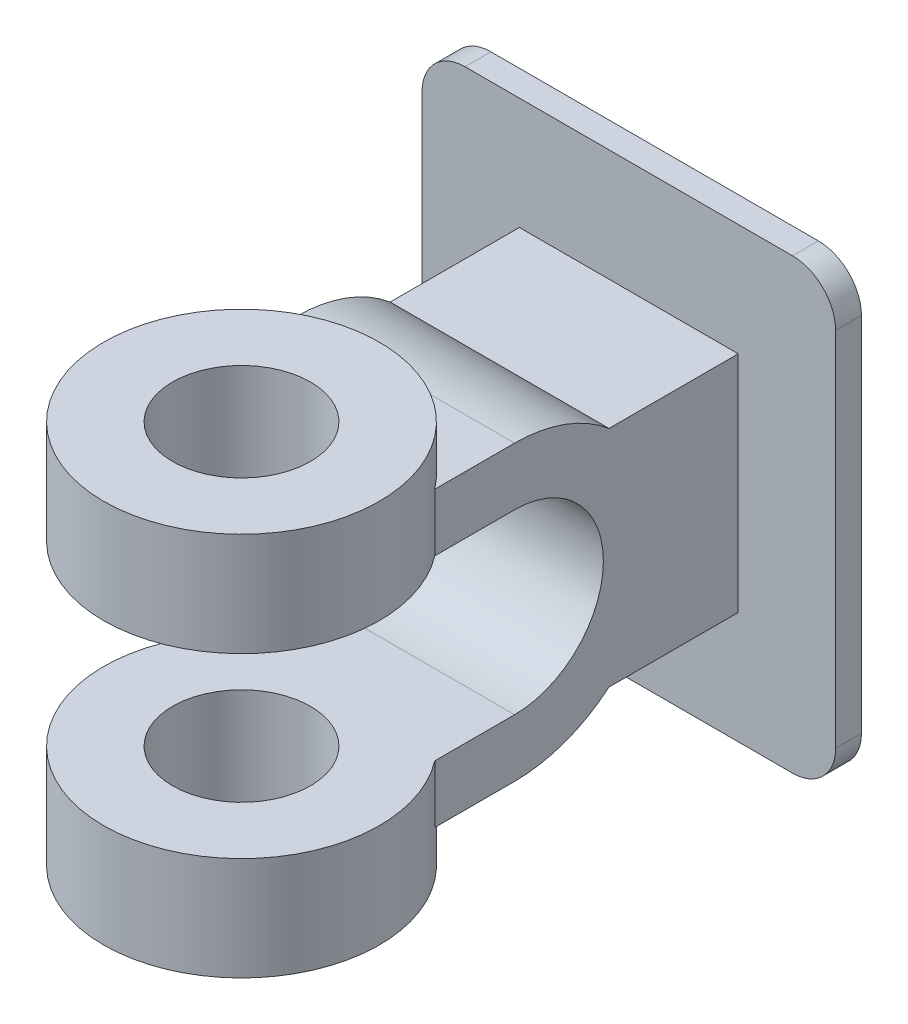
ISO-10303-21;
HEADER;
FILE_DESCRIPTION(('STEP AP214'),'2;1');
FILE_NAME('part.step','',(''),(''),'','','');
FILE_SCHEMA(('AUTOMOTIVE_DESIGN { 1 0 10303 214 1 1 1 1 }'));
ENDSEC;
DATA;
#1=APPLICATION_CONTEXT('core data for automotive mechanical design processes');
#2=APPLICATION_PROTOCOL_DEFINITION('international standard','automotive_design',2000,#1);
#3=PRODUCT_CONTEXT('',#1,'mechanical');
#4=PRODUCT('Part','Part','',(#3));
#5=PRODUCT_RELATED_PRODUCT_CATEGORY('part','',(#4));
#6=PRODUCT_DEFINITION_FORMATION('','',#4);
#7=PRODUCT_DEFINITION_CONTEXT('part definition',#1,'design');
#8=PRODUCT_DEFINITION('design','',#6,#7);
#9=PRODUCT_DEFINITION_SHAPE('','',#8);
#10=(LENGTH_UNIT() NAMED_UNIT(*) SI_UNIT(.MILLI.,.METRE.));
#11=(NAMED_UNIT(*) PLANE_ANGLE_UNIT() SI_UNIT($,.RADIAN.));
#12=(NAMED_UNIT(*) SI_UNIT($,.STERADIAN.) SOLID_ANGLE_UNIT());
#13=UNCERTAINTY_MEASURE_WITH_UNIT(LENGTH_MEASURE(1.E-05),#10,'distance_accuracy_value','');
#14=(GEOMETRIC_REPRESENTATION_CONTEXT(3) GLOBAL_UNCERTAINTY_ASSIGNED_CONTEXT((#13)) GLOBAL_UNIT_ASSIGNED_CONTEXT((#10,
#11,#12)) REPRESENTATION_CONTEXT('',''));
#15=CARTESIAN_POINT('',(0.,0.,0.));
#16=DIRECTION('',(0.,0.,1.));
#17=DIRECTION('',(1.,0.,0.));
#18=AXIS2_PLACEMENT_3D('',#15,#16,#17);
#19=CARTESIAN_POINT('',(5.55625,0.,-1.99024165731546));
#20=DIRECTION('',(1.,0.,0.));
#21=DIRECTION('',(0.,0.,-1.));
#22=AXIS2_PLACEMENT_3D('',#19,#20,#21);
#23=PLANE('',#22);
#24=DIRECTION('',(0.,0.,1.));
#25=VECTOR('',#24,1.);
#26=CARTESIAN_POINT('',(5.55625,7.4375,-1.99024165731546));
#27=LINE('',#26,#25);
#28=CARTESIAN_POINT('',(5.55625,7.4375,-1.99024165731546));
#29=VERTEX_POINT('',#28);
#30=CARTESIAN_POINT('',(5.55625,7.4375,2.06454934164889));
#31=VERTEX_POINT('',#30);
#32=EDGE_CURVE('E390',#29,#31,#27,.T.);
#33=ORIENTED_EDGE('',*,*,#32,.T.);
#34=DIRECTION('',(0.,-1.,0.));
#35=VECTOR('',#34,1.);
#36=CARTESIAN_POINT('',(5.55625,9.75625,2.06454934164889));
#37=LINE('',#36,#35);
#38=CARTESIAN_POINT('',(5.55625,4.50625,2.06454934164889));
#39=VERTEX_POINT('',#38);
#40=EDGE_CURVE('E342',#31,#39,#37,.T.);
#41=ORIENTED_EDGE('',*,*,#40,.T.);
#42=DIRECTION('',(0.,0.,-1.));
#43=VECTOR('',#42,1.);
#44=CARTESIAN_POINT('',(5.55625,4.50625,-1.99024165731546));
#45=LINE('',#44,#43);
#46=CARTESIAN_POINT('',(5.55625,4.50625,-1.99024165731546));
#47=VERTEX_POINT('',#46);
#48=EDGE_CURVE('E394',#39,#47,#45,.T.);
#49=ORIENTED_EDGE('',*,*,#48,.T.);
#50=CARTESIAN_POINT('',(5.55625,0.,-1.99024165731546));
#51=DIRECTION('',(-1.,0.,0.));
#52=DIRECTION('',(0.,0.,-1.));
#53=AXIS2_PLACEMENT_3D('',#50,#51,#52);
#54=CIRCLE('',#53,4.50625);
#55=CARTESIAN_POINT('',(5.55625,-4.50625,-1.99024165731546));
#56=VERTEX_POINT('',#55);
#57=EDGE_CURVE('E364',#47,#56,#54,.T.);
#58=ORIENTED_EDGE('',*,*,#57,.T.);
#59=DIRECTION('',(0.,0.,1.));
#60=VECTOR('',#59,1.);
#61=CARTESIAN_POINT('',(5.55625,-4.50625,-1.99024165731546));
#62=LINE('',#61,#60);
#63=CARTESIAN_POINT('',(5.55625,-4.50625,2.06454934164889));
#64=VERTEX_POINT('',#63);
#65=EDGE_CURVE('E368',#56,#64,#62,.T.);
#66=ORIENTED_EDGE('',*,*,#65,.T.);
#67=DIRECTION('',(0.,1.,0.));
#68=VECTOR('',#67,1.);
#69=CARTESIAN_POINT('',(5.55625,-9.75625,2.06454934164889));
#70=LINE('',#69,#68);
#71=CARTESIAN_POINT('',(5.55625,-7.4375,2.06454934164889));
#72=VERTEX_POINT('',#71);
#73=EDGE_CURVE('E360',#72,#64,#70,.T.);
#74=ORIENTED_EDGE('',*,*,#73,.F.);
#75=DIRECTION('',(0.,0.,-1.));
#76=VECTOR('',#75,1.);
#77=CARTESIAN_POINT('',(5.55625,-7.4375,-1.99024165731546));
#78=LINE('',#77,#76);
#79=CARTESIAN_POINT('',(5.55625,-7.4375,-1.99024165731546));
#80=VERTEX_POINT('',#79);
#81=EDGE_CURVE('E373',#72,#80,#78,.T.);
#82=ORIENTED_EDGE('',*,*,#81,.T.);
#83=CARTESIAN_POINT('',(5.55625,0.,-1.99024165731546));
#84=DIRECTION('',(1.,0.,0.));
#85=DIRECTION('',(0.,0.,-1.));
#86=AXIS2_PLACEMENT_3D('',#83,#84,#85);
#87=CIRCLE('',#86,7.4375);
#88=CARTESIAN_POINT('',(5.55625,-5.6875,-6.78281403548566));
#89=VERTEX_POINT('',#88);
#90=EDGE_CURVE('E376',#80,#89,#87,.T.);
#91=ORIENTED_EDGE('',*,*,#90,.T.);
#92=DIRECTION('',(0.,0.,-1.));
#93=VECTOR('',#92,1.);
#94=CARTESIAN_POINT('',(5.55625,-5.6875,-6.78281403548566));
#95=LINE('',#94,#93);
#96=CARTESIAN_POINT('',(5.55625,-5.6875,-13.3453140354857));
#97=VERTEX_POINT('',#96);
#98=EDGE_CURVE('E379',#89,#97,#95,.T.);
#99=ORIENTED_EDGE('',*,*,#98,.T.);
#100=DIRECTION('',(0.,1.,0.));
#101=VECTOR('',#100,1.);
#102=CARTESIAN_POINT('',(5.55625,5.6875,-13.3453140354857));
#103=LINE('',#102,#101);
#104=CARTESIAN_POINT('',(5.55625,5.6875,-13.3453140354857));
#105=VERTEX_POINT('',#104);
#106=EDGE_CURVE('E217',#97,#105,#103,.T.);
#107=ORIENTED_EDGE('',*,*,#106,.T.);
#108=DIRECTION('',(0.,0.,1.));
#109=VECTOR('',#108,1.);
#110=CARTESIAN_POINT('',(5.55625,5.6875,-6.78281403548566));
#111=LINE('',#110,#109);
#112=CARTESIAN_POINT('',(5.55625,5.6875,-6.78281403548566));
#113=VERTEX_POINT('',#112);
#114=EDGE_CURVE('E384',#105,#113,#111,.T.);
#115=ORIENTED_EDGE('',*,*,#114,.T.);
#116=CARTESIAN_POINT('',(5.55625,0.,-1.99024165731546));
#117=DIRECTION('',(1.,0.,0.));
#118=DIRECTION('',(0.,0.,-1.));
#119=AXIS2_PLACEMENT_3D('',#116,#117,#118);
#120=CIRCLE('',#119,7.4375);
#121=EDGE_CURVE('E387',#113,#29,#120,.T.);
#122=ORIENTED_EDGE('',*,*,#121,.T.);
#123=EDGE_LOOP('',(#33,#41,#49,#58,#66,#74,#82,#91,#99,#107,#115,#122));
#124=FACE_BOUND('',#123,.T.);
#125=ADVANCED_FACE('F50',(#124),#23,.T.);
#126=CARTESIAN_POINT('',(-5.55625,0.,-1.99024165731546));
#127=DIRECTION('',(1.,0.,0.));
#128=DIRECTION('',(0.,0.,-1.));
#129=AXIS2_PLACEMENT_3D('',#126,#127,#128);
#130=PLANE('',#129);
#131=DIRECTION('',(0.,-1.,0.));
#132=VECTOR('',#131,1.);
#133=CARTESIAN_POINT('',(-5.55625,9.75625,2.06454934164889));
#134=LINE('',#133,#132);
#135=CARTESIAN_POINT('',(-5.55625,7.4375,2.06454934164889));
#136=VERTEX_POINT('',#135);
#137=CARTESIAN_POINT('',(-5.55625,4.50625,2.06454934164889));
#138=VERTEX_POINT('',#137);
#139=EDGE_CURVE('E240',#136,#138,#134,.T.);
#140=ORIENTED_EDGE('',*,*,#139,.F.);
#141=DIRECTION('',(0.,0.,1.));
#142=VECTOR('',#141,1.);
#143=CARTESIAN_POINT('',(-5.55625,7.4375,-1.99024165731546));
#144=LINE('',#143,#142);
#145=CARTESIAN_POINT('',(-5.55625,7.4375,-1.99024165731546));
#146=VERTEX_POINT('',#145);
#147=EDGE_CURVE('E415',#146,#136,#144,.T.);
#148=ORIENTED_EDGE('',*,*,#147,.F.);
#149=CARTESIAN_POINT('',(-5.55625,0.,-1.99024165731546));
#150=DIRECTION('',(1.,0.,0.));
#151=DIRECTION('',(0.,0.,-1.));
#152=AXIS2_PLACEMENT_3D('',#149,#150,#151);
#153=CIRCLE('',#152,7.4375);
#154=CARTESIAN_POINT('',(-5.55625,5.6875,-6.78281403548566));
#155=VERTEX_POINT('',#154);
#156=EDGE_CURVE('E412',#155,#146,#153,.T.);
#157=ORIENTED_EDGE('',*,*,#156,.F.);
#158=DIRECTION('',(0.,0.,1.));
#159=VECTOR('',#158,1.);
#160=CARTESIAN_POINT('',(-5.55625,5.6875,-6.78281403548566));
#161=LINE('',#160,#159);
#162=CARTESIAN_POINT('',(-5.55625,5.6875,-13.3453140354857));
#163=VERTEX_POINT('',#162);
#164=EDGE_CURVE('E197',#163,#155,#161,.T.);
#165=ORIENTED_EDGE('',*,*,#164,.F.);
#166=DIRECTION('',(0.,1.,0.));
#167=VECTOR('',#166,1.);
#168=CARTESIAN_POINT('',(-5.55625,5.6875,-13.3453140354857));
#169=LINE('',#168,#167);
#170=CARTESIAN_POINT('',(-5.55625,-5.6875,-13.3453140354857));
#171=VERTEX_POINT('',#170);
#172=EDGE_CURVE('E190',#171,#163,#169,.T.);
#173=ORIENTED_EDGE('',*,*,#172,.F.);
#174=DIRECTION('',(0.,0.,-1.));
#175=VECTOR('',#174,1.);
#176=CARTESIAN_POINT('',(-5.55625,-5.6875,-6.78281403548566));
#177=LINE('',#176,#175);
#178=CARTESIAN_POINT('',(-5.55625,-5.6875,-6.78281403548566));
#179=VERTEX_POINT('',#178);
#180=EDGE_CURVE('E195',#179,#171,#177,.T.);
#181=ORIENTED_EDGE('',*,*,#180,.F.);
#182=CARTESIAN_POINT('',(-5.55625,0.,-1.99024165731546));
#183=DIRECTION('',(1.,0.,0.));
#184=DIRECTION('',(0.,0.,-1.));
#185=AXIS2_PLACEMENT_3D('',#182,#183,#184);
#186=CIRCLE('',#185,7.4375);
#187=CARTESIAN_POINT('',(-5.55625,-7.4375,-1.99024165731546));
#188=VERTEX_POINT('',#187);
#189=EDGE_CURVE('E213',#188,#179,#186,.T.);
#190=ORIENTED_EDGE('',*,*,#189,.F.);
#191=DIRECTION('',(0.,0.,-1.));
#192=VECTOR('',#191,1.);
#193=CARTESIAN_POINT('',(-5.55625,-7.4375,-1.99024165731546));
#194=LINE('',#193,#192);
#195=CARTESIAN_POINT('',(-5.55625,-7.4375,2.06454934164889));
#196=VERTEX_POINT('',#195);
#197=EDGE_CURVE('E405',#196,#188,#194,.T.);
#198=ORIENTED_EDGE('',*,*,#197,.F.);
#199=DIRECTION('',(0.,1.,0.));
#200=VECTOR('',#199,1.);
#201=CARTESIAN_POINT('',(-5.55625,-9.75625,2.06454934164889));
#202=LINE('',#201,#200);
#203=CARTESIAN_POINT('',(-5.55625,-4.50625,2.06454934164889));
#204=VERTEX_POINT('',#203);
#205=EDGE_CURVE('E236',#196,#204,#202,.T.);
#206=ORIENTED_EDGE('',*,*,#205,.T.);
#207=DIRECTION('',(0.,0.,1.));
#208=VECTOR('',#207,1.);
#209=CARTESIAN_POINT('',(-5.55625,-4.50625,-1.99024165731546));
#210=LINE('',#209,#208);
#211=CARTESIAN_POINT('',(-5.55625,-4.50625,-1.99024165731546));
#212=VERTEX_POINT('',#211);
#213=EDGE_CURVE('E401',#212,#204,#210,.T.);
#214=ORIENTED_EDGE('',*,*,#213,.F.);
#215=CARTESIAN_POINT('',(-5.55625,0.,-1.99024165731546));
#216=DIRECTION('',(-1.,0.,0.));
#217=DIRECTION('',(0.,0.,-1.));
#218=AXIS2_PLACEMENT_3D('',#215,#216,#217);
#219=CIRCLE('',#218,4.50625);
#220=CARTESIAN_POINT('',(-5.55625,4.50625,-1.99024165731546));
#221=VERTEX_POINT('',#220);
#222=EDGE_CURVE('E363',#221,#212,#219,.T.);
#223=ORIENTED_EDGE('',*,*,#222,.F.);
#224=DIRECTION('',(0.,0.,-1.));
#225=VECTOR('',#224,1.);
#226=CARTESIAN_POINT('',(-5.55625,4.50625,-1.99024165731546));
#227=LINE('',#226,#225);
#228=EDGE_CURVE('E369',#138,#221,#227,.T.);
#229=ORIENTED_EDGE('',*,*,#228,.F.);
#230=EDGE_LOOP('',(#140,#148,#157,#165,#173,#181,#190,#198,#206,#214,#223,#229));
#231=FACE_BOUND('',#230,.T.);
#232=ADVANCED_FACE('F193',(#231),#130,.F.);
#233=CARTESIAN_POINT('',(5.55625,0.,-1.99024165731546));
#234=DIRECTION('',(-1.,0.,0.));
#235=DIRECTION('',(0.,0.,1.));
#236=AXIS2_PLACEMENT_3D('',#233,#234,#235);
#237=CYLINDRICAL_SURFACE('',#236,4.50625);
#238=ORIENTED_EDGE('',*,*,#222,.T.);
#239=DIRECTION('',(-1.,0.,0.));
#240=VECTOR('',#239,1.);
#241=CARTESIAN_POINT('',(5.55625,-4.50625,-1.99024165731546));
#242=LINE('',#241,#240);
#243=EDGE_CURVE('E232',#56,#212,#242,.T.);
#244=ORIENTED_EDGE('',*,*,#243,.F.);
#245=ORIENTED_EDGE('',*,*,#57,.F.);
#246=DIRECTION('',(-1.,0.,0.));
#247=VECTOR('',#246,1.);
#248=CARTESIAN_POINT('',(5.55625,4.50625,-1.99024165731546));
#249=LINE('',#248,#247);
#250=EDGE_CURVE('E397',#47,#221,#249,.T.);
#251=ORIENTED_EDGE('',*,*,#250,.T.);
#252=EDGE_LOOP('',(#238,#244,#245,#251));
#253=FACE_BOUND('',#252,.T.);
#254=ADVANCED_FACE('F459',(#253),#237,.F.);
#255=CARTESIAN_POINT('',(5.55625,-4.50625,-1.99024165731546));
#256=DIRECTION('',(0.,-1.,0.));
#257=DIRECTION('',(0.,0.,-1.));
#258=AXIS2_PLACEMENT_3D('',#255,#256,#257);
#259=PLANE('',#258);
#260=CARTESIAN_POINT('',(0.,-4.50625,6.32225834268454));
#261=DIRECTION('',(0.,1.,0.));
#262=DIRECTION('',(0.,0.,1.));
#263=AXIS2_PLACEMENT_3D('',#260,#261,#262);
#264=CIRCLE('',#263,3.5);
#265=CARTESIAN_POINT('',(0.,-4.50625,9.82225834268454));
#266=VERTEX_POINT('',#265);
#267=EDGE_CURVE('E246',#266,#266,#264,.T.);
#268=ORIENTED_EDGE('',*,*,#267,.F.);
#269=EDGE_LOOP('',(#268));
#270=FACE_BOUND('',#269,.T.);
#271=ORIENTED_EDGE('',*,*,#213,.T.);
#272=CARTESIAN_POINT('',(0.,-4.50625,6.32225834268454));
#273=DIRECTION('',(0.,1.,0.));
#274=DIRECTION('',(0.,0.,1.));
#275=AXIS2_PLACEMENT_3D('',#272,#273,#274);
#276=CIRCLE('',#275,7.);
#277=EDGE_CURVE('E245',#204,#64,#276,.T.);
#278=ORIENTED_EDGE('',*,*,#277,.T.);
#279=ORIENTED_EDGE('',*,*,#65,.F.);
#280=ORIENTED_EDGE('',*,*,#243,.T.);
#281=EDGE_LOOP('',(#271,#278,#279,#280));
#282=FACE_BOUND('',#281,.T.);
#283=ADVANCED_FACE('F673',(#270,#282),#259,.F.);
#284=CARTESIAN_POINT('',(5.55625,-7.4375,-1.99024165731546));
#285=DIRECTION('',(0.,1.,0.));
#286=DIRECTION('',(0.,0.,1.));
#287=AXIS2_PLACEMENT_3D('',#284,#285,#286);
#288=PLANE('',#287);
#289=ORIENTED_EDGE('',*,*,#81,.F.);
#290=CARTESIAN_POINT('',(0.,-7.4375,6.32225834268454));
#291=DIRECTION('',(0.,1.,0.));
#292=DIRECTION('',(0.,0.,1.));
#293=AXIS2_PLACEMENT_3D('',#290,#291,#292);
#294=CIRCLE('',#293,7.);
#295=EDGE_CURVE('E353',#72,#196,#294,.T.);
#296=ORIENTED_EDGE('',*,*,#295,.T.);
#297=ORIENTED_EDGE('',*,*,#197,.T.);
#298=DIRECTION('',(-1.,0.,0.));
#299=VECTOR('',#298,1.);
#300=CARTESIAN_POINT('',(5.55625,-7.4375,-1.99024165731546));
#301=LINE('',#300,#299);
#302=EDGE_CURVE('E223',#80,#188,#301,.T.);
#303=ORIENTED_EDGE('',*,*,#302,.F.);
#304=EDGE_LOOP('',(#289,#296,#297,#303));
#305=FACE_BOUND('',#304,.T.);
#306=ADVANCED_FACE('F664',(#305),#288,.F.);
#307=CARTESIAN_POINT('',(5.55625,0.,-1.99024165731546));
#308=DIRECTION('',(-1.,0.,0.));
#309=DIRECTION('',(0.,0.,1.));
#310=AXIS2_PLACEMENT_3D('',#307,#308,#309);
#311=CYLINDRICAL_SURFACE('',#310,7.4375);
#312=ORIENTED_EDGE('',*,*,#189,.T.);
#313=DIRECTION('',(-1.,0.,0.));
#314=VECTOR('',#313,1.);
#315=CARTESIAN_POINT('',(5.55625,-5.6875,-6.78281403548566));
#316=LINE('',#315,#314);
#317=EDGE_CURVE('E211',#89,#179,#316,.T.);
#318=ORIENTED_EDGE('',*,*,#317,.F.);
#319=ORIENTED_EDGE('',*,*,#90,.F.);
#320=ORIENTED_EDGE('',*,*,#302,.T.);
#321=EDGE_LOOP('',(#312,#318,#319,#320));
#322=FACE_BOUND('',#321,.T.);
#323=ADVANCED_FACE('F452',(#322),#311,.T.);
#324=CARTESIAN_POINT('',(5.55625,-5.6875,-6.78281403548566));
#325=DIRECTION('',(0.,1.,0.));
#326=DIRECTION('',(0.,0.,1.));
#327=AXIS2_PLACEMENT_3D('',#324,#325,#326);
#328=PLANE('',#327);
#329=ORIENTED_EDGE('',*,*,#180,.T.);
#330=DIRECTION('',(-1.,0.,0.));
#331=VECTOR('',#330,1.);
#332=CARTESIAN_POINT('',(5.55625,-5.6875,-13.3453140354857));
#333=LINE('',#332,#331);
#334=EDGE_CURVE('E208',#97,#171,#333,.T.);
#335=ORIENTED_EDGE('',*,*,#334,.F.);
#336=ORIENTED_EDGE('',*,*,#98,.F.);
#337=ORIENTED_EDGE('',*,*,#317,.T.);
#338=EDGE_LOOP('',(#329,#335,#336,#337));
#339=FACE_BOUND('',#338,.T.);
#340=ADVANCED_FACE('F206',(#339),#328,.F.);
#341=CARTESIAN_POINT('',(5.55625,5.6875,-6.78281403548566));
#342=DIRECTION('',(0.,-1.,0.));
#343=DIRECTION('',(0.,0.,-1.));
#344=AXIS2_PLACEMENT_3D('',#341,#342,#343);
#345=PLANE('',#344);
#346=ORIENTED_EDGE('',*,*,#164,.T.);
#347=DIRECTION('',(-1.,0.,0.));
#348=VECTOR('',#347,1.);
#349=CARTESIAN_POINT('',(5.55625,5.6875,-6.78281403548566));
#350=LINE('',#349,#348);
#351=EDGE_CURVE('E225',#113,#155,#350,.T.);
#352=ORIENTED_EDGE('',*,*,#351,.F.);
#353=ORIENTED_EDGE('',*,*,#114,.F.);
#354=DIRECTION('',(-1.,0.,0.));
#355=VECTOR('',#354,1.);
#356=CARTESIAN_POINT('',(5.55625,5.6875,-13.3453140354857));
#357=LINE('',#356,#355);
#358=EDGE_CURVE('E219',#105,#163,#357,.T.);
#359=ORIENTED_EDGE('',*,*,#358,.T.);
#360=EDGE_LOOP('',(#346,#352,#353,#359));
#361=FACE_BOUND('',#360,.T.);
#362=ADVANCED_FACE('F444',(#361),#345,.F.);
#363=CARTESIAN_POINT('',(5.55625,0.,-1.99024165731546));
#364=DIRECTION('',(-1.,0.,0.));
#365=DIRECTION('',(0.,0.,1.));
#366=AXIS2_PLACEMENT_3D('',#363,#364,#365);
#367=CYLINDRICAL_SURFACE('',#366,7.4375);
#368=ORIENTED_EDGE('',*,*,#156,.T.);
#369=DIRECTION('',(-1.,0.,0.));
#370=VECTOR('',#369,1.);
#371=CARTESIAN_POINT('',(5.55625,7.4375,-1.99024165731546));
#372=LINE('',#371,#370);
#373=EDGE_CURVE('E424',#29,#146,#372,.T.);
#374=ORIENTED_EDGE('',*,*,#373,.F.);
#375=ORIENTED_EDGE('',*,*,#121,.F.);
#376=ORIENTED_EDGE('',*,*,#351,.T.);
#377=EDGE_LOOP('',(#368,#374,#375,#376));
#378=FACE_BOUND('',#377,.T.);
#379=ADVANCED_FACE('F432',(#378),#367,.T.);
#380=CARTESIAN_POINT('',(5.55625,7.4375,-1.99024165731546));
#381=DIRECTION('',(0.,-1.,0.));
#382=DIRECTION('',(0.,0.,-1.));
#383=AXIS2_PLACEMENT_3D('',#380,#381,#382);
#384=PLANE('',#383);
#385=CARTESIAN_POINT('',(0.,7.4375,6.32225834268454));
#386=DIRECTION('',(0.,-1.,0.));
#387=DIRECTION('',(0.,0.,-1.));
#388=AXIS2_PLACEMENT_3D('',#385,#386,#387);
#389=CIRCLE('',#388,7.);
#390=EDGE_CURVE('E337',#31,#136,#389,.F.);
#391=ORIENTED_EDGE('',*,*,#390,.F.);
#392=ORIENTED_EDGE('',*,*,#32,.F.);
#393=ORIENTED_EDGE('',*,*,#373,.T.);
#394=ORIENTED_EDGE('',*,*,#147,.T.);
#395=EDGE_LOOP('',(#391,#392,#393,#394));
#396=FACE_BOUND('',#395,.T.);
#397=ADVANCED_FACE('F440',(#396),#384,.F.);
#398=CARTESIAN_POINT('',(5.55625,4.50625,-1.99024165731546));
#399=DIRECTION('',(0.,1.,0.));
#400=DIRECTION('',(0.,0.,1.));
#401=AXIS2_PLACEMENT_3D('',#398,#399,#400);
#402=PLANE('',#401);
#403=CARTESIAN_POINT('',(0.,4.50625,6.32225834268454));
#404=DIRECTION('',(0.,1.,0.));
#405=DIRECTION('',(0.,0.,1.));
#406=AXIS2_PLACEMENT_3D('',#403,#404,#405);
#407=CIRCLE('',#406,3.5);
#408=CARTESIAN_POINT('',(0.,4.50625,2.82225834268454));
#409=VERTEX_POINT('',#408);
#410=EDGE_CURVE('E256',#409,#409,#407,.T.);
#411=ORIENTED_EDGE('',*,*,#410,.T.);
#412=EDGE_LOOP('',(#411));
#413=FACE_BOUND('',#412,.T.);
#414=ORIENTED_EDGE('',*,*,#48,.F.);
#415=CARTESIAN_POINT('',(0.,4.50625,6.32225834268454));
#416=DIRECTION('',(0.,1.,0.));
#417=DIRECTION('',(0.,0.,1.));
#418=AXIS2_PLACEMENT_3D('',#415,#416,#417);
#419=CIRCLE('',#418,7.);
#420=EDGE_CURVE('E255',#138,#39,#419,.T.);
#421=ORIENTED_EDGE('',*,*,#420,.F.);
#422=ORIENTED_EDGE('',*,*,#228,.T.);
#423=ORIENTED_EDGE('',*,*,#250,.F.);
#424=EDGE_LOOP('',(#414,#421,#422,#423));
#425=FACE_BOUND('',#424,.T.);
#426=ADVANCED_FACE('F465',(#413,#425),#402,.F.);
#427=CARTESIAN_POINT('',(0.,-9.75625,6.32225834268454));
#428=DIRECTION('',(0.,1.,0.));
#429=DIRECTION('',(0.,0.,1.));
#430=AXIS2_PLACEMENT_3D('',#427,#428,#429);
#431=CYLINDRICAL_SURFACE('',#430,7.);
#432=CARTESIAN_POINT('',(0.,-9.75625,6.32225834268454));
#433=DIRECTION('',(0.,1.,0.));
#434=DIRECTION('',(0.,0.,1.));
#435=AXIS2_PLACEMENT_3D('',#432,#433,#434);
#436=CIRCLE('',#435,7.);
#437=CARTESIAN_POINT('',(0.,-9.75625,13.3222583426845));
#438=VERTEX_POINT('',#437);
#439=EDGE_CURVE('E349',#438,#438,#436,.T.);
#440=ORIENTED_EDGE('',*,*,#439,.T.);
#441=EDGE_LOOP('',(#440));
#442=FACE_BOUND('',#441,.T.);
#443=ORIENTED_EDGE('',*,*,#295,.F.);
#444=ORIENTED_EDGE('',*,*,#73,.T.);
#445=ORIENTED_EDGE('',*,*,#277,.F.);
#446=ORIENTED_EDGE('',*,*,#205,.F.);
#447=EDGE_LOOP('',(#443,#444,#445,#446));
#448=FACE_BOUND('',#447,.T.);
#449=ADVANCED_FACE('F462',(#442,#448),#431,.T.);
#450=CARTESIAN_POINT('',(0.,-9.75625,6.32225834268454));
#451=DIRECTION('',(0.,1.,0.));
#452=DIRECTION('',(0.,0.,1.));
#453=AXIS2_PLACEMENT_3D('',#450,#451,#452);
#454=PLANE('',#453);
#455=CARTESIAN_POINT('',(0.,-9.75625,6.32225834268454));
#456=DIRECTION('',(0.,1.,0.));
#457=DIRECTION('',(0.,0.,1.));
#458=AXIS2_PLACEMENT_3D('',#455,#456,#457);
#459=CIRCLE('',#458,3.5);
#460=CARTESIAN_POINT('',(0.,-9.75625,9.82225834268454));
#461=VERTEX_POINT('',#460);
#462=EDGE_CURVE('E241',#461,#461,#459,.T.);
#463=ORIENTED_EDGE('',*,*,#462,.T.);
#464=EDGE_LOOP('',(#463));
#465=FACE_BOUND('',#464,.T.);
#466=ORIENTED_EDGE('',*,*,#439,.F.);
#467=EDGE_LOOP('',(#466));
#468=FACE_BOUND('',#467,.T.);
#469=ADVANCED_FACE('F488',(#465,#468),#454,.F.);
#470=CARTESIAN_POINT('',(0.,-15.88125,6.32225834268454));
#471=DIRECTION('',(0.,1.,0.));
#472=DIRECTION('',(0.,0.,1.));
#473=AXIS2_PLACEMENT_3D('',#470,#471,#472);
#474=CYLINDRICAL_SURFACE('',#473,3.5);
#475=CARTESIAN_POINT('',(0.,-4.50625,9.82225834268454));
#476=CARTESIAN_POINT('',(0.,-4.5609375,9.82225834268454));
#477=CARTESIAN_POINT('',(0.,-4.615625,9.82225834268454));
#478=CARTESIAN_POINT('',(0.,-4.725,9.82225834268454));
#479=CARTESIAN_POINT('',(0.,-4.7796875,9.82225834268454));
#480=CARTESIAN_POINT('',(0.,-4.8890625,9.82225834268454));
#481=CARTESIAN_POINT('',(0.,-4.94375,9.82225834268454));
#482=CARTESIAN_POINT('',(0.,-5.053125,9.82225834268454));
#483=CARTESIAN_POINT('',(0.,-5.1078125,9.82225834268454));
#484=CARTESIAN_POINT('',(0.,-5.2171875,9.82225834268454));
#485=CARTESIAN_POINT('',(0.,-5.271875,9.82225834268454));
#486=CARTESIAN_POINT('',(0.,-5.38125,9.82225834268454));
#487=CARTESIAN_POINT('',(0.,-5.4359375,9.82225834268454));
#488=CARTESIAN_POINT('',(0.,-5.5453125,9.82225834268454));
#489=CARTESIAN_POINT('',(0.,-5.6,9.82225834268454));
#490=CARTESIAN_POINT('',(0.,-5.709375,9.82225834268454));
#491=CARTESIAN_POINT('',(0.,-5.7640625,9.82225834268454));
#492=CARTESIAN_POINT('',(0.,-5.8734375,9.82225834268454));
#493=CARTESIAN_POINT('',(0.,-5.928125,9.82225834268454));
#494=CARTESIAN_POINT('',(0.,-6.0375,9.82225834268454));
#495=CARTESIAN_POINT('',(0.,-6.0921875,9.82225834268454));
#496=CARTESIAN_POINT('',(0.,-6.2015625,9.82225834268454));
#497=CARTESIAN_POINT('',(0.,-6.25625,9.82225834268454));
#498=CARTESIAN_POINT('',(0.,-6.365625,9.82225834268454));
#499=CARTESIAN_POINT('',(0.,-6.4203125,9.82225834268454));
#500=CARTESIAN_POINT('',(0.,-6.5296875,9.82225834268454));
#501=CARTESIAN_POINT('',(0.,-6.584375,9.82225834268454));
#502=CARTESIAN_POINT('',(0.,-6.69375,9.82225834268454));
#503=CARTESIAN_POINT('',(0.,-6.7484375,9.82225834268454));
#504=CARTESIAN_POINT('',(0.,-6.8578125,9.82225834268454));
#505=CARTESIAN_POINT('',(0.,-6.9125,9.82225834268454));
#506=CARTESIAN_POINT('',(0.,-7.021875,9.82225834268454));
#507=CARTESIAN_POINT('',(0.,-7.0765625,9.82225834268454));
#508=CARTESIAN_POINT('',(0.,-7.1859375,9.82225834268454));
#509=CARTESIAN_POINT('',(0.,-7.240625,9.82225834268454));
#510=CARTESIAN_POINT('',(0.,-7.35,9.82225834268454));
#511=CARTESIAN_POINT('',(0.,-7.4046875,9.82225834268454));
#512=CARTESIAN_POINT('',(0.,-7.5140625,9.82225834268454));
#513=CARTESIAN_POINT('',(0.,-7.56875,9.82225834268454));
#514=CARTESIAN_POINT('',(0.,-7.678125,9.82225834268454));
#515=CARTESIAN_POINT('',(0.,-7.7328125,9.82225834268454));
#516=CARTESIAN_POINT('',(0.,-7.8421875,9.82225834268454));
#517=CARTESIAN_POINT('',(0.,-7.896875,9.82225834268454));
#518=CARTESIAN_POINT('',(0.,-8.00625,9.82225834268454));
#519=CARTESIAN_POINT('',(0.,-8.0609375,9.82225834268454));
#520=CARTESIAN_POINT('',(0.,-8.1703125,9.82225834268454));
#521=CARTESIAN_POINT('',(0.,-8.225,9.82225834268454));
#522=CARTESIAN_POINT('',(0.,-8.334375,9.82225834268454));
#523=CARTESIAN_POINT('',(0.,-8.3890625,9.82225834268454));
#524=CARTESIAN_POINT('',(0.,-8.4984375,9.82225834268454));
#525=CARTESIAN_POINT('',(0.,-8.553125,9.82225834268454));
#526=CARTESIAN_POINT('',(0.,-8.6625,9.82225834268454));
#527=CARTESIAN_POINT('',(0.,-8.7171875,9.82225834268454));
#528=CARTESIAN_POINT('',(0.,-8.8265625,9.82225834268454));
#529=CARTESIAN_POINT('',(0.,-8.88125,9.82225834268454));
#530=CARTESIAN_POINT('',(0.,-8.990625,9.82225834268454));
#531=CARTESIAN_POINT('',(0.,-9.0453125,9.82225834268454));
#532=CARTESIAN_POINT('',(0.,-9.1546875,9.82225834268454));
#533=CARTESIAN_POINT('',(0.,-9.209375,9.82225834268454));
#534=CARTESIAN_POINT('',(0.,-9.31875,9.82225834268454));
#535=CARTESIAN_POINT('',(0.,-9.3734375,9.82225834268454));
#536=CARTESIAN_POINT('',(0.,-9.4828125,9.82225834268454));
#537=CARTESIAN_POINT('',(0.,-9.5375,9.82225834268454));
#538=CARTESIAN_POINT('',(0.,-9.646875,9.82225834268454));
#539=CARTESIAN_POINT('',(0.,-9.7015625,9.82225834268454));
#540=CARTESIAN_POINT('',(0.,-9.75625,9.82225834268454));
#541=B_SPLINE_CURVE_WITH_KNOTS('',3,(#475,#476,#477,#478,#479,#480,#481,#482,#483,#484,#485,
#486,#487,#488,#489,#490,#491,#492,#493,#494,#495,#496,#497,#498,#499,#500,#501,#502,#503,#504,
#505,#506,#507,#508,#509,#510,#511,#512,#513,#514,#515,#516,#517,#518,#519,#520,#521,#522,#523,
#524,#525,#526,#527,#528,#529,#530,#531,#532,#533,#534,#535,#536,#537,#538,#539,#540),
.UNSPECIFIED.,.F.,.F.,(4,2,2,2,2,2,2,2,2,2,2,2,2,2,2,2,2,2,2,2,2,2,2,2,2,2,2,2,2,2,2,2,4),(0.,
0.164062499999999,0.328125,0.4921875,0.656250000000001,0.8203125,0.984375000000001,1.1484375,
1.3125,1.4765625,1.640625,1.8046875,1.96875,2.1328125,2.296875,2.4609375,2.625,2.7890625,
2.953125,3.1171875,3.28125,3.4453125,3.609375,3.7734375,3.9375,4.1015625,4.265625,4.4296875,
4.59375,4.7578125,4.921875,5.0859375,5.25),.UNSPECIFIED.);
#542=EDGE_CURVE('BSEAM497',#266,#461,#541,.T.);
#543=ORIENTED_EDGE('',*,*,#267,.T.);
#544=ORIENTED_EDGE('',*,*,#462,.F.);
#545=ORIENTED_EDGE('',*,*,#542,.T.);
#546=ORIENTED_EDGE('',*,*,#542,.F.);
#547=EDGE_LOOP('',(#543,#545,#544,#546));
#548=FACE_BOUND('',#547,.T.);
#549=ADVANCED_FACE('F497',(#548),#474,.F.);
#550=CARTESIAN_POINT('',(0.,9.75625,6.32225834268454));
#551=DIRECTION('',(0.,-1.,0.));
#552=DIRECTION('',(0.,0.,-1.));
#553=AXIS2_PLACEMENT_3D('',#550,#551,#552);
#554=CYLINDRICAL_SURFACE('',#553,7.);
#555=ORIENTED_EDGE('',*,*,#40,.F.);
#556=ORIENTED_EDGE('',*,*,#390,.T.);
#557=ORIENTED_EDGE('',*,*,#139,.T.);
#558=ORIENTED_EDGE('',*,*,#420,.T.);
#559=EDGE_LOOP('',(#555,#556,#557,#558));
#560=FACE_BOUND('',#559,.T.);
#561=CARTESIAN_POINT('',(0.,9.75625,6.32225834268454));
#562=DIRECTION('',(0.,1.,0.));
#563=DIRECTION('',(0.,0.,1.));
#564=AXIS2_PLACEMENT_3D('',#561,#562,#563);
#565=CIRCLE('',#564,7.);
#566=CARTESIAN_POINT('',(0.,9.75625,13.3222583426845));
#567=VERTEX_POINT('',#566);
#568=EDGE_CURVE('E333',#567,#567,#565,.T.);
#569=ORIENTED_EDGE('',*,*,#568,.F.);
#570=EDGE_LOOP('',(#569));
#571=FACE_BOUND('',#570,.T.);
#572=ADVANCED_FACE('F505',(#560,#571),#554,.T.);
#573=CARTESIAN_POINT('',(0.,9.75625,6.32225834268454));
#574=DIRECTION('',(0.,-1.,0.));
#575=DIRECTION('',(0.,0.,1.));
#576=AXIS2_PLACEMENT_3D('',#573,#574,#575);
#577=PLANE('',#576);
#578=CARTESIAN_POINT('',(0.,9.75625,6.32225834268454));
#579=DIRECTION('',(0.,-1.,0.));
#580=DIRECTION('',(0.,0.,-1.));
#581=AXIS2_PLACEMENT_3D('',#578,#579,#580);
#582=CIRCLE('',#581,3.5);
#583=CARTESIAN_POINT('',(0.,9.75625,2.82225834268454));
#584=VERTEX_POINT('',#583);
#585=EDGE_CURVE('E251',#584,#584,#582,.F.);
#586=ORIENTED_EDGE('',*,*,#585,.F.);
#587=EDGE_LOOP('',(#586));
#588=FACE_BOUND('',#587,.T.);
#589=ORIENTED_EDGE('',*,*,#568,.T.);
#590=EDGE_LOOP('',(#589));
#591=FACE_BOUND('',#590,.T.);
#592=ADVANCED_FACE('F514',(#588,#591),#577,.F.);
#593=CARTESIAN_POINT('',(0.,15.88125,6.32225834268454));
#594=DIRECTION('',(0.,-1.,0.));
#595=DIRECTION('',(0.,0.,-1.));
#596=AXIS2_PLACEMENT_3D('',#593,#594,#595);
#597=CYLINDRICAL_SURFACE('',#596,3.5);
#598=CARTESIAN_POINT('',(0.,4.50625,2.82225834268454));
#599=CARTESIAN_POINT('',(0.,4.5609375,2.82225834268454));
#600=CARTESIAN_POINT('',(0.,4.615625,2.82225834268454));
#601=CARTESIAN_POINT('',(0.,4.725,2.82225834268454));
#602=CARTESIAN_POINT('',(0.,4.7796875,2.82225834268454));
#603=CARTESIAN_POINT('',(0.,4.8890625,2.82225834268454));
#604=CARTESIAN_POINT('',(0.,4.94375,2.82225834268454));
#605=CARTESIAN_POINT('',(0.,5.053125,2.82225834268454));
#606=CARTESIAN_POINT('',(0.,5.1078125,2.82225834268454));
#607=CARTESIAN_POINT('',(0.,5.2171875,2.82225834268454));
#608=CARTESIAN_POINT('',(0.,5.271875,2.82225834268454));
#609=CARTESIAN_POINT('',(0.,5.38125,2.82225834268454));
#610=CARTESIAN_POINT('',(0.,5.4359375,2.82225834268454));
#611=CARTESIAN_POINT('',(0.,5.5453125,2.82225834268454));
#612=CARTESIAN_POINT('',(0.,5.6,2.82225834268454));
#613=CARTESIAN_POINT('',(0.,5.709375,2.82225834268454));
#614=CARTESIAN_POINT('',(0.,5.7640625,2.82225834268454));
#615=CARTESIAN_POINT('',(0.,5.8734375,2.82225834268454));
#616=CARTESIAN_POINT('',(0.,5.928125,2.82225834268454));
#617=CARTESIAN_POINT('',(0.,6.0375,2.82225834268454));
#618=CARTESIAN_POINT('',(0.,6.0921875,2.82225834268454));
#619=CARTESIAN_POINT('',(0.,6.2015625,2.82225834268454));
#620=CARTESIAN_POINT('',(0.,6.25625,2.82225834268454));
#621=CARTESIAN_POINT('',(0.,6.365625,2.82225834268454));
#622=CARTESIAN_POINT('',(0.,6.4203125,2.82225834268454));
#623=CARTESIAN_POINT('',(0.,6.5296875,2.82225834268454));
#624=CARTESIAN_POINT('',(0.,6.584375,2.82225834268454));
#625=CARTESIAN_POINT('',(0.,6.69375,2.82225834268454));
#626=CARTESIAN_POINT('',(0.,6.7484375,2.82225834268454));
#627=CARTESIAN_POINT('',(0.,6.8578125,2.82225834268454));
#628=CARTESIAN_POINT('',(0.,6.9125,2.82225834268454));
#629=CARTESIAN_POINT('',(0.,7.021875,2.82225834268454));
#630=CARTESIAN_POINT('',(0.,7.0765625,2.82225834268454));
#631=CARTESIAN_POINT('',(0.,7.1859375,2.82225834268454));
#632=CARTESIAN_POINT('',(0.,7.240625,2.82225834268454));
#633=CARTESIAN_POINT('',(0.,7.35,2.82225834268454));
#634=CARTESIAN_POINT('',(0.,7.4046875,2.82225834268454));
#635=CARTESIAN_POINT('',(0.,7.5140625,2.82225834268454));
#636=CARTESIAN_POINT('',(0.,7.56875,2.82225834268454));
#637=CARTESIAN_POINT('',(0.,7.678125,2.82225834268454));
#638=CARTESIAN_POINT('',(0.,7.7328125,2.82225834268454));
#639=CARTESIAN_POINT('',(0.,7.8421875,2.82225834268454));
#640=CARTESIAN_POINT('',(0.,7.896875,2.82225834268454));
#641=CARTESIAN_POINT('',(0.,8.00625,2.82225834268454));
#642=CARTESIAN_POINT('',(0.,8.0609375,2.82225834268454));
#643=CARTESIAN_POINT('',(0.,8.1703125,2.82225834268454));
#644=CARTESIAN_POINT('',(0.,8.225,2.82225834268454));
#645=CARTESIAN_POINT('',(0.,8.334375,2.82225834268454));
#646=CARTESIAN_POINT('',(0.,8.3890625,2.82225834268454));
#647=CARTESIAN_POINT('',(0.,8.4984375,2.82225834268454));
#648=CARTESIAN_POINT('',(0.,8.553125,2.82225834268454));
#649=CARTESIAN_POINT('',(0.,8.6625,2.82225834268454));
#650=CARTESIAN_POINT('',(0.,8.7171875,2.82225834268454));
#651=CARTESIAN_POINT('',(0.,8.8265625,2.82225834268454));
#652=CARTESIAN_POINT('',(0.,8.88125,2.82225834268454));
#653=CARTESIAN_POINT('',(0.,8.990625,2.82225834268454));
#654=CARTESIAN_POINT('',(0.,9.0453125,2.82225834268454));
#655=CARTESIAN_POINT('',(0.,9.1546875,2.82225834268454));
#656=CARTESIAN_POINT('',(0.,9.209375,2.82225834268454));
#657=CARTESIAN_POINT('',(0.,9.31875,2.82225834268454));
#658=CARTESIAN_POINT('',(0.,9.3734375,2.82225834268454));
#659=CARTESIAN_POINT('',(0.,9.4828125,2.82225834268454));
#660=CARTESIAN_POINT('',(0.,9.5375,2.82225834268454));
#661=CARTESIAN_POINT('',(0.,9.646875,2.82225834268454));
#662=CARTESIAN_POINT('',(0.,9.7015625,2.82225834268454));
#663=CARTESIAN_POINT('',(0.,9.75625,2.82225834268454));
#664=B_SPLINE_CURVE_WITH_KNOTS('',3,(#598,#599,#600,#601,#602,#603,#604,#605,#606,#607,#608,
#609,#610,#611,#612,#613,#614,#615,#616,#617,#618,#619,#620,#621,#622,#623,#624,#625,#626,#627,
#628,#629,#630,#631,#632,#633,#634,#635,#636,#637,#638,#639,#640,#641,#642,#643,#644,#645,#646,
#647,#648,#649,#650,#651,#652,#653,#654,#655,#656,#657,#658,#659,#660,#661,#662,#663),
.UNSPECIFIED.,.F.,.F.,(4,2,2,2,2,2,2,2,2,2,2,2,2,2,2,2,2,2,2,2,2,2,2,2,2,2,2,2,2,2,2,2,4),(0.,
0.164062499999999,0.328125,0.4921875,0.656250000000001,0.8203125,0.984375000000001,1.1484375,
1.3125,1.4765625,1.640625,1.8046875,1.96875,2.1328125,2.296875,2.4609375,2.625,2.7890625,
2.953125,3.1171875,3.28125,3.4453125,3.609375,3.7734375,3.9375,4.1015625,4.265625,4.4296875,
4.59375,4.7578125,4.921875,5.0859375,5.25),.UNSPECIFIED.);
#665=EDGE_CURVE('BSEAM523',#409,#584,#664,.T.);
#666=ORIENTED_EDGE('',*,*,#410,.F.);
#667=ORIENTED_EDGE('',*,*,#585,.T.);
#668=ORIENTED_EDGE('',*,*,#665,.T.);
#669=ORIENTED_EDGE('',*,*,#665,.F.);
#670=EDGE_LOOP('',(#666,#668,#667,#669));
#671=FACE_BOUND('',#670,.T.);
#672=ADVANCED_FACE('F523',(#671),#597,.F.);
#673=CARTESIAN_POINT('',(-10.5,-11.375,-14.6578140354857));
#674=DIRECTION('',(1.,0.,0.));
#675=DIRECTION('',(0.,0.,-1.));
#676=AXIS2_PLACEMENT_3D('',#673,#674,#675);
#677=PLANE('',#676);
#678=DIRECTION('',(0.,1.,0.));
#679=VECTOR('',#678,1.);
#680=CARTESIAN_POINT('',(-10.5,-11.375,-14.6578140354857));
#681=LINE('',#680,#679);
#682=CARTESIAN_POINT('',(-10.5,-9.1875,-14.6578140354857));
#683=VERTEX_POINT('',#682);
#684=CARTESIAN_POINT('',(-10.5,9.18749999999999,-14.6578140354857));
#685=VERTEX_POINT('',#684);
#686=EDGE_CURVE('E328',#683,#685,#681,.T.);
#687=ORIENTED_EDGE('',*,*,#686,.F.);
#688=DIRECTION('',(0.,0.,1.));
#689=VECTOR('',#688,1.);
#690=CARTESIAN_POINT('',(-10.5,-9.1875,-14.6578140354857));
#691=LINE('',#690,#689);
#692=CARTESIAN_POINT('',(-10.5,-9.1875,-13.3453140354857));
#693=VERTEX_POINT('',#692);
#694=EDGE_CURVE('E259',#683,#693,#691,.T.);
#695=ORIENTED_EDGE('',*,*,#694,.T.);
#696=DIRECTION('',(0.,1.,0.));
#697=VECTOR('',#696,1.);
#698=CARTESIAN_POINT('',(-10.5,-11.375,-13.3453140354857));
#699=LINE('',#698,#697);
#700=CARTESIAN_POINT('',(-10.5,9.18749999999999,-13.3453140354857));
#701=VERTEX_POINT('',#700);
#702=EDGE_CURVE('E316',#693,#701,#699,.T.);
#703=ORIENTED_EDGE('',*,*,#702,.T.);
#704=DIRECTION('',(0.,0.,1.));
#705=VECTOR('',#704,1.);
#706=CARTESIAN_POINT('',(-10.5,9.1875,-14.6578140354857));
#707=LINE('',#706,#705);
#708=EDGE_CURVE('E250',#701,#685,#707,.F.);
#709=ORIENTED_EDGE('',*,*,#708,.T.);
#710=EDGE_LOOP('',(#687,#695,#703,#709));
#711=FACE_BOUND('',#710,.T.);
#712=ADVANCED_FACE('F532',(#711),#677,.F.);
#713=CARTESIAN_POINT('',(10.5,11.375,-14.6578140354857));
#714=DIRECTION('',(0.,-1.,0.));
#715=DIRECTION('',(0.,0.,-1.));
#716=AXIS2_PLACEMENT_3D('',#713,#714,#715);
#717=PLANE('',#716);
#718=DIRECTION('',(1.,0.,0.));
#719=VECTOR('',#718,1.);
#720=CARTESIAN_POINT('',(10.5,11.375,-13.3453140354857));
#721=LINE('',#720,#719);
#722=CARTESIAN_POINT('',(-8.31249999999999,11.375,-13.3453140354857));
#723=VERTEX_POINT('',#722);
#724=CARTESIAN_POINT('',(8.3125,11.375,-13.3453140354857));
#725=VERTEX_POINT('',#724);
#726=EDGE_CURVE('E306',#723,#725,#721,.T.);
#727=ORIENTED_EDGE('',*,*,#726,.T.);
#728=DIRECTION('',(0.,0.,1.));
#729=VECTOR('',#728,1.);
#730=CARTESIAN_POINT('',(8.3125,11.375,-14.6578140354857));
#731=LINE('',#730,#729);
#732=CARTESIAN_POINT('',(8.3125,11.375,-14.6578140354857));
#733=VERTEX_POINT('',#732);
#734=EDGE_CURVE('E12',#725,#733,#731,.F.);
#735=ORIENTED_EDGE('',*,*,#734,.T.);
#736=DIRECTION('',(1.,0.,0.));
#737=VECTOR('',#736,1.);
#738=CARTESIAN_POINT('',(10.5,11.375,-14.6578140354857));
#739=LINE('',#738,#737);
#740=CARTESIAN_POINT('',(-8.31249999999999,11.375,-14.6578140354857));
#741=VERTEX_POINT('',#740);
#742=EDGE_CURVE('E308',#741,#733,#739,.T.);
#743=ORIENTED_EDGE('',*,*,#742,.F.);
#744=DIRECTION('',(0.,0.,1.));
#745=VECTOR('',#744,1.);
#746=CARTESIAN_POINT('',(-8.31249999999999,11.375,-14.6578140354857));
#747=LINE('',#746,#745);
#748=EDGE_CURVE('E59',#741,#723,#747,.T.);
#749=ORIENTED_EDGE('',*,*,#748,.T.);
#750=EDGE_LOOP('',(#727,#735,#743,#749));
#751=FACE_BOUND('',#750,.T.);
#752=ADVANCED_FACE('F305',(#751),#717,.F.);
#753=CARTESIAN_POINT('',(10.5,-11.375,-14.6578140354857));
#754=DIRECTION('',(-1.,0.,0.));
#755=DIRECTION('',(0.,0.,1.));
#756=AXIS2_PLACEMENT_3D('',#753,#754,#755);
#757=PLANE('',#756);
#758=DIRECTION('',(0.,-1.,0.));
#759=VECTOR('',#758,1.);
#760=CARTESIAN_POINT('',(10.5,-11.375,-13.3453140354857));
#761=LINE('',#760,#759);
#762=CARTESIAN_POINT('',(10.5,9.18749999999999,-13.3453140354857));
#763=VERTEX_POINT('',#762);
#764=CARTESIAN_POINT('',(10.5,-9.1875,-13.3453140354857));
#765=VERTEX_POINT('',#764);
#766=EDGE_CURVE('E315',#763,#765,#761,.T.);
#767=ORIENTED_EDGE('',*,*,#766,.T.);
#768=DIRECTION('',(0.,0.,1.));
#769=VECTOR('',#768,1.);
#770=CARTESIAN_POINT('',(10.5,-9.1875,-14.6578140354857));
#771=LINE('',#770,#769);
#772=CARTESIAN_POINT('',(10.5,-9.1875,-14.6578140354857));
#773=VERTEX_POINT('',#772);
#774=EDGE_CURVE('E66',#765,#773,#771,.F.);
#775=ORIENTED_EDGE('',*,*,#774,.T.);
#776=DIRECTION('',(0.,-1.,0.));
#777=VECTOR('',#776,1.);
#778=CARTESIAN_POINT('',(10.5,-11.375,-14.6578140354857));
#779=LINE('',#778,#777);
#780=CARTESIAN_POINT('',(10.5,9.18749999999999,-14.6578140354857));
#781=VERTEX_POINT('',#780);
#782=EDGE_CURVE('E728',#781,#773,#779,.T.);
#783=ORIENTED_EDGE('',*,*,#782,.F.);
#784=DIRECTION('',(0.,0.,1.));
#785=VECTOR('',#784,1.);
#786=CARTESIAN_POINT('',(10.5,9.1875,-14.6578140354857));
#787=LINE('',#786,#785);
#788=EDGE_CURVE('E293',#781,#763,#787,.T.);
#789=ORIENTED_EDGE('',*,*,#788,.T.);
#790=EDGE_LOOP('',(#767,#775,#783,#789));
#791=FACE_BOUND('',#790,.T.);
#792=ADVANCED_FACE('F549',(#791),#757,.F.);
#793=CARTESIAN_POINT('',(10.5,-11.375,-14.6578140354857));
#794=DIRECTION('',(0.,1.,0.));
#795=DIRECTION('',(0.,0.,1.));
#796=AXIS2_PLACEMENT_3D('',#793,#794,#795);
#797=PLANE('',#796);
#798=DIRECTION('',(-1.,0.,0.));
#799=VECTOR('',#798,1.);
#800=CARTESIAN_POINT('',(10.5,-11.375,-13.3453140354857));
#801=LINE('',#800,#799);
#802=CARTESIAN_POINT('',(8.3125,-11.375,-13.3453140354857));
#803=VERTEX_POINT('',#802);
#804=CARTESIAN_POINT('',(-8.31249999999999,-11.375,-13.3453140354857));
#805=VERTEX_POINT('',#804);
#806=EDGE_CURVE('E320',#803,#805,#801,.T.);
#807=ORIENTED_EDGE('',*,*,#806,.T.);
#808=DIRECTION('',(0.,0.,1.));
#809=VECTOR('',#808,1.);
#810=CARTESIAN_POINT('',(-8.31249999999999,-11.375,-14.6578140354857));
#811=LINE('',#810,#809);
#812=CARTESIAN_POINT('',(-8.31249999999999,-11.375,-14.6578140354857));
#813=VERTEX_POINT('',#812);
#814=EDGE_CURVE('E279',#805,#813,#811,.F.);
#815=ORIENTED_EDGE('',*,*,#814,.T.);
#816=DIRECTION('',(-1.,0.,0.));
#817=VECTOR('',#816,1.);
#818=CARTESIAN_POINT('',(10.5,-11.375,-14.6578140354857));
#819=LINE('',#818,#817);
#820=CARTESIAN_POINT('',(8.3125,-11.375,-14.6578140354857));
#821=VERTEX_POINT('',#820);
#822=EDGE_CURVE('E332',#821,#813,#819,.T.);
#823=ORIENTED_EDGE('',*,*,#822,.F.);
#824=DIRECTION('',(0.,0.,1.));
#825=VECTOR('',#824,1.);
#826=CARTESIAN_POINT('',(8.3125,-11.375,-14.6578140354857));
#827=LINE('',#826,#825);
#828=EDGE_CURVE('E275',#821,#803,#827,.T.);
#829=ORIENTED_EDGE('',*,*,#828,.T.);
#830=EDGE_LOOP('',(#807,#815,#823,#829));
#831=FACE_BOUND('',#830,.T.);
#832=ADVANCED_FACE('F557',(#831),#797,.F.);
#833=CARTESIAN_POINT('',(0.,0.,-14.6578140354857));
#834=DIRECTION('',(0.,0.,1.));
#835=DIRECTION('',(0.,-1.,0.));
#836=AXIS2_PLACEMENT_3D('',#833,#834,#835);
#837=PLANE('',#836);
#838=ORIENTED_EDGE('',*,*,#822,.T.);
#839=CARTESIAN_POINT('',(-8.31249999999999,-9.1875,-14.6578140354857));
#840=DIRECTION('',(0.,0.,1.));
#841=DIRECTION('',(0.,-1.,0.));
#842=AXIS2_PLACEMENT_3D('',#839,#840,#841);
#843=CIRCLE('',#842,2.1875);
#844=EDGE_CURVE('E290',#813,#683,#843,.F.);
#845=ORIENTED_EDGE('',*,*,#844,.T.);
#846=ORIENTED_EDGE('',*,*,#686,.T.);
#847=CARTESIAN_POINT('',(-8.31249999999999,9.1875,-14.6578140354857));
#848=DIRECTION('',(0.,0.,1.));
#849=DIRECTION('',(0.,-1.,0.));
#850=AXIS2_PLACEMENT_3D('',#847,#848,#849);
#851=CIRCLE('',#850,2.1875);
#852=EDGE_CURVE('E282',#685,#741,#851,.F.);
#853=ORIENTED_EDGE('',*,*,#852,.T.);
#854=ORIENTED_EDGE('',*,*,#742,.T.);
#855=CARTESIAN_POINT('',(8.3125,9.1875,-14.6578140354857));
#856=DIRECTION('',(0.,0.,1.));
#857=DIRECTION('',(0.,-1.,0.));
#858=AXIS2_PLACEMENT_3D('',#855,#856,#857);
#859=CIRCLE('',#858,2.1875);
#860=EDGE_CURVE('E73',#733,#781,#859,.F.);
#861=ORIENTED_EDGE('',*,*,#860,.T.);
#862=ORIENTED_EDGE('',*,*,#782,.T.);
#863=CARTESIAN_POINT('',(8.3125,-9.1875,-14.6578140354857));
#864=DIRECTION('',(0.,0.,1.));
#865=DIRECTION('',(0.,-1.,0.));
#866=AXIS2_PLACEMENT_3D('',#863,#864,#865);
#867=CIRCLE('',#866,2.1875);
#868=EDGE_CURVE('E287',#773,#821,#867,.F.);
#869=ORIENTED_EDGE('',*,*,#868,.T.);
#870=EDGE_LOOP('',(#838,#845,#846,#853,#854,#861,#862,#869));
#871=FACE_BOUND('',#870,.T.);
#872=ADVANCED_FACE('F565',(#871),#837,.F.);
#873=CARTESIAN_POINT('',(0.,0.,-13.3453140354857));
#874=DIRECTION('',(0.,0.,1.));
#875=DIRECTION('',(0.,-1.,0.));
#876=AXIS2_PLACEMENT_3D('',#873,#874,#875);
#877=PLANE('',#876);
#878=ORIENTED_EDGE('',*,*,#334,.T.);
#879=ORIENTED_EDGE('',*,*,#172,.T.);
#880=ORIENTED_EDGE('',*,*,#358,.F.);
#881=ORIENTED_EDGE('',*,*,#106,.F.);
#882=EDGE_LOOP('',(#878,#879,#880,#881));
#883=FACE_BOUND('',#882,.T.);
#884=ORIENTED_EDGE('',*,*,#702,.F.);
#885=CARTESIAN_POINT('',(-8.31249999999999,-9.1875,-13.3453140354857));
#886=DIRECTION('',(0.,0.,1.));
#887=DIRECTION('',(0.,-1.,0.));
#888=AXIS2_PLACEMENT_3D('',#885,#886,#887);
#889=CIRCLE('',#888,2.1875);
#890=EDGE_CURVE('E272',#693,#805,#889,.T.);
#891=ORIENTED_EDGE('',*,*,#890,.T.);
#892=ORIENTED_EDGE('',*,*,#806,.F.);
#893=CARTESIAN_POINT('',(8.3125,-9.1875,-13.3453140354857));
#894=DIRECTION('',(0.,0.,1.));
#895=DIRECTION('',(0.,-1.,0.));
#896=AXIS2_PLACEMENT_3D('',#893,#894,#895);
#897=CIRCLE('',#896,2.1875);
#898=EDGE_CURVE('E269',#803,#765,#897,.T.);
#899=ORIENTED_EDGE('',*,*,#898,.T.);
#900=ORIENTED_EDGE('',*,*,#766,.F.);
#901=CARTESIAN_POINT('',(8.3125,9.1875,-13.3453140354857));
#902=DIRECTION('',(0.,0.,1.));
#903=DIRECTION('',(0.,-1.,0.));
#904=AXIS2_PLACEMENT_3D('',#901,#902,#903);
#905=CIRCLE('',#904,2.1875);
#906=EDGE_CURVE('E266',#763,#725,#905,.T.);
#907=ORIENTED_EDGE('',*,*,#906,.T.);
#908=ORIENTED_EDGE('',*,*,#726,.F.);
#909=CARTESIAN_POINT('',(-8.31249999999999,9.1875,-13.3453140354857));
#910=DIRECTION('',(0.,0.,1.));
#911=DIRECTION('',(0.,-1.,0.));
#912=AXIS2_PLACEMENT_3D('',#909,#910,#911);
#913=CIRCLE('',#912,2.1875);
#914=EDGE_CURVE('E263',#723,#701,#913,.T.);
#915=ORIENTED_EDGE('',*,*,#914,.T.);
#916=EDGE_LOOP('',(#884,#891,#892,#899,#900,#907,#908,#915));
#917=FACE_BOUND('',#916,.T.);
#918=ADVANCED_FACE('F215',(#883,#917),#877,.T.);
#919=CARTESIAN_POINT('',(-8.31249999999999,-9.1875,-14.6578140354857));
#920=DIRECTION('',(0.,0.,1.));
#921=DIRECTION('',(0.,-1.,0.));
#922=AXIS2_PLACEMENT_3D('',#919,#920,#921);
#923=CYLINDRICAL_SURFACE('',#922,2.1875);
#924=ORIENTED_EDGE('',*,*,#844,.F.);
#925=ORIENTED_EDGE('',*,*,#814,.F.);
#926=ORIENTED_EDGE('',*,*,#890,.F.);
#927=ORIENTED_EDGE('',*,*,#694,.F.);
#928=EDGE_LOOP('',(#924,#925,#926,#927));
#929=FACE_BOUND('',#928,.T.);
#930=ADVANCED_FACE('F581',(#929),#923,.T.);
#931=CARTESIAN_POINT('',(8.3125,-9.1875,-14.6578140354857));
#932=DIRECTION('',(0.,0.,1.));
#933=DIRECTION('',(0.,-1.,0.));
#934=AXIS2_PLACEMENT_3D('',#931,#932,#933);
#935=CYLINDRICAL_SURFACE('',#934,2.1875);
#936=ORIENTED_EDGE('',*,*,#868,.F.);
#937=ORIENTED_EDGE('',*,*,#774,.F.);
#938=ORIENTED_EDGE('',*,*,#898,.F.);
#939=ORIENTED_EDGE('',*,*,#828,.F.);
#940=EDGE_LOOP('',(#936,#937,#938,#939));
#941=FACE_BOUND('',#940,.T.);
#942=ADVANCED_FACE('F589',(#941),#935,.T.);
#943=CARTESIAN_POINT('',(8.3125,9.1875,-14.6578140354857));
#944=DIRECTION('',(0.,0.,1.));
#945=DIRECTION('',(0.,-1.,0.));
#946=AXIS2_PLACEMENT_3D('',#943,#944,#945);
#947=CYLINDRICAL_SURFACE('',#946,2.1875);
#948=ORIENTED_EDGE('',*,*,#860,.F.);
#949=ORIENTED_EDGE('',*,*,#734,.F.);
#950=ORIENTED_EDGE('',*,*,#906,.F.);
#951=ORIENTED_EDGE('',*,*,#788,.F.);
#952=EDGE_LOOP('',(#948,#949,#950,#951));
#953=FACE_BOUND('',#952,.T.);
#954=ADVANCED_FACE('F598',(#953),#947,.T.);
#955=CARTESIAN_POINT('',(-8.31249999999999,9.1875,-14.6578140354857));
#956=DIRECTION('',(0.,0.,1.));
#957=DIRECTION('',(0.,-1.,0.));
#958=AXIS2_PLACEMENT_3D('',#955,#956,#957);
#959=CYLINDRICAL_SURFACE('',#958,2.1875);
#960=ORIENTED_EDGE('',*,*,#852,.F.);
#961=ORIENTED_EDGE('',*,*,#708,.F.);
#962=ORIENTED_EDGE('',*,*,#914,.F.);
#963=ORIENTED_EDGE('',*,*,#748,.F.);
#964=EDGE_LOOP('',(#960,#961,#962,#963));
#965=FACE_BOUND('',#964,.T.);
#966=ADVANCED_FACE('F52',(#965),#959,.T.);
#967=CLOSED_SHELL('',(#125,#232,#254,#283,#306,#323,#340,#362,#379,#397,#426,#449,#469,#549,
#572,#592,#672,#712,#752,#792,#832,#872,#918,#930,#942,#954,#966));
#968=MANIFOLD_SOLID_BREP('B2',#967);
#969=ADVANCED_BREP_SHAPE_REPRESENTATION('',(#18,#968),#14);
#970=SHAPE_DEFINITION_REPRESENTATION(#9,#969);
ENDSEC;
END-ISO-10303-21;
